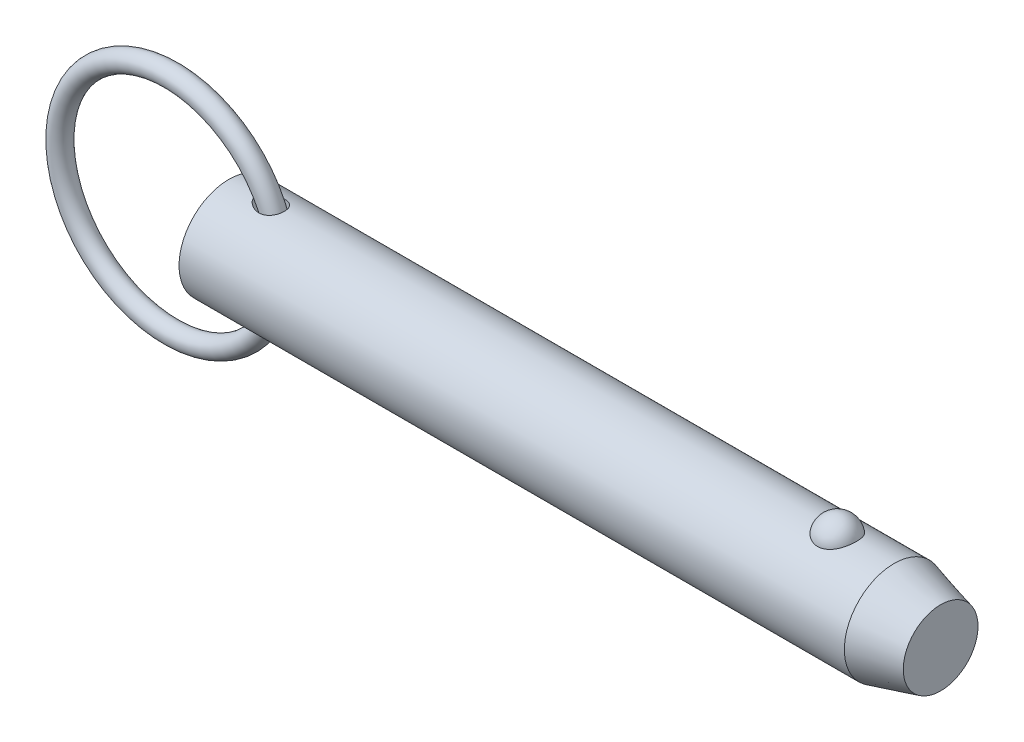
ISO-10303-21;
HEADER;
FILE_DESCRIPTION(('STEP AP214'),'2;1');
FILE_NAME('part.step','',(''),(''),'','','');
FILE_SCHEMA(('AUTOMOTIVE_DESIGN { 1 0 10303 214 1 1 1 1 }'));
ENDSEC;
DATA;
#1=APPLICATION_CONTEXT('core data for automotive mechanical design processes');
#2=APPLICATION_PROTOCOL_DEFINITION('international standard','automotive_design',2000,#1);
#3=PRODUCT_CONTEXT('',#1,'mechanical');
#4=PRODUCT('Part','Part','',(#3));
#5=PRODUCT_RELATED_PRODUCT_CATEGORY('part','',(#4));
#6=PRODUCT_DEFINITION_FORMATION('','',#4);
#7=PRODUCT_DEFINITION_CONTEXT('part definition',#1,'design');
#8=PRODUCT_DEFINITION('design','',#6,#7);
#9=PRODUCT_DEFINITION_SHAPE('','',#8);
#10=(LENGTH_UNIT() NAMED_UNIT(*) SI_UNIT(.MILLI.,.METRE.));
#11=(NAMED_UNIT(*) PLANE_ANGLE_UNIT() SI_UNIT($,.RADIAN.));
#12=(NAMED_UNIT(*) SI_UNIT($,.STERADIAN.) SOLID_ANGLE_UNIT());
#13=UNCERTAINTY_MEASURE_WITH_UNIT(LENGTH_MEASURE(1.E-05),#10,'distance_accuracy_value','');
#14=(GEOMETRIC_REPRESENTATION_CONTEXT(3) GLOBAL_UNCERTAINTY_ASSIGNED_CONTEXT((#13)) GLOBAL_UNIT_ASSIGNED_CONTEXT((#10,
#11,#12)) REPRESENTATION_CONTEXT('',''));
#15=CARTESIAN_POINT('',(0.,0.,0.));
#16=DIRECTION('',(0.,0.,1.));
#17=DIRECTION('',(1.,0.,0.));
#18=AXIS2_PLACEMENT_3D('',#15,#16,#17);
#19=CARTESIAN_POINT('',(-8.23730968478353,0.,0.));
#20=DIRECTION('',(0.,0.,1.));
#21=DIRECTION('',(1.,0.,0.));
#22=AXIS2_PLACEMENT_3D('',#19,#20,#21);
#23=TOROIDAL_SURFACE('',#22,15.875,1.422);
#24=CARTESIAN_POINT('',(9.05969031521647,0.,0.));
#25=VERTEX_POINT('',#24);
#26=VERTEX_LOOP('',#25);
#27=FACE_BOUND('',#26,.T.);
#28=ADVANCED_FACE('P0_F12',(#27),#23,.T.);
#29=CLOSED_SHELL('',(#28));
#30=MANIFOLD_SOLID_BREP('P0_B1',#29);
#31=CARTESIAN_POINT('',(0.,0.,0.));
#32=DIRECTION('',(1.,0.,0.));
#33=DIRECTION('',(0.,0.,-1.));
#34=AXIS2_PLACEMENT_3D('',#31,#32,#33);
#35=CYLINDRICAL_SURFACE('',#34,7.11);
#36=CARTESIAN_POINT('',(3.98467340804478,7.10072679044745,-0.363013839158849));
#37=CARTESIAN_POINT('',(4.00971652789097,7.09600153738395,-0.45539194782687));
#38=CARTESIAN_POINT('',(4.04401947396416,7.08958406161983,-0.545230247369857));
#39=CARTESIAN_POINT('',(4.12810160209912,7.07427055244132,-0.717157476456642));
#40=CARTESIAN_POINT('',(4.17791765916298,7.06536861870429,-0.799227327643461));
#41=CARTESIAN_POINT('',(4.28924471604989,7.04620300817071,-0.953469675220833));
#42=CARTESIAN_POINT('',(4.35063580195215,7.035953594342,-1.02573162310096));
#43=CARTESIAN_POINT('',(4.48282610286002,7.01493313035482,-1.16081412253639));
#44=CARTESIAN_POINT('',(4.55362244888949,7.00416223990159,-1.22363754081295));
#45=CARTESIAN_POINT('',(4.71659336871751,6.98090398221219,-1.35055080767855));
#46=CARTESIAN_POINT('',(4.81029272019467,6.96847103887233,-1.41269256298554));
#47=CARTESIAN_POINT('',(5.0057240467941,6.94515366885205,-1.52319699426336));
#48=CARTESIAN_POINT('',(5.10746392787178,6.93427079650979,-1.57154588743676));
#49=CARTESIAN_POINT('',(5.33503739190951,6.91346066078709,-1.66091325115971));
#50=CARTESIAN_POINT('',(5.46199550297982,6.90402388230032,-1.69921932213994));
#51=CARTESIAN_POINT('',(5.72084799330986,6.89024030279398,-1.75428261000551));
#52=CARTESIAN_POINT('',(5.85274301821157,6.88589416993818,-1.77103699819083));
#53=CARTESIAN_POINT('',(6.11557710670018,6.88337277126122,-1.78081990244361));
#54=CARTESIAN_POINT('',(6.24650031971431,6.88510489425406,-1.77420448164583));
#55=CARTESIAN_POINT('',(6.50446311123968,6.89478744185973,-1.73620392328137));
#56=CARTESIAN_POINT('',(6.6315075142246,6.90272978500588,-1.70485097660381));
#57=CARTESIAN_POINT('',(6.85933269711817,6.92243075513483,-1.62281888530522));
#58=CARTESIAN_POINT('',(6.96133251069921,6.93352131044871,-1.5753580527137));
#59=CARTESIAN_POINT('',(7.15436649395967,6.95824811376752,-1.46226310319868));
#60=CARTESIAN_POINT('',(7.24540699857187,6.97188287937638,-1.3966395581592));
#61=CARTESIAN_POINT('',(7.40446019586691,6.99838217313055,-1.25668991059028));
#62=CARTESIAN_POINT('',(7.473875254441,7.01118308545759,-1.18393777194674));
#63=CARTESIAN_POINT('',(7.59904891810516,7.03582803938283,-1.02736918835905));
#64=CARTESIAN_POINT('',(7.65481029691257,7.04767227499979,-0.943554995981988));
#65=CARTESIAN_POINT('',(7.74982438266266,7.06873077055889,-0.76979592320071));
#66=CARTESIAN_POINT('',(7.7894903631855,7.07800861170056,-0.680084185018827));
#67=CARTESIAN_POINT('',(7.85354088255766,7.09334756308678,-0.495102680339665));
#68=CARTESIAN_POINT('',(7.87792559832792,7.09940871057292,-0.399832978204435));
#69=CARTESIAN_POINT('',(7.9108898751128,7.10766731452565,-0.206294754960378));
#70=CARTESIAN_POINT('',(7.91944662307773,7.10985919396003,-0.108022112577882));
#71=CARTESIAN_POINT('',(7.920501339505,7.11012756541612,0.0886168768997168));
#72=CARTESIAN_POINT('',(7.91299895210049,7.10820396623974,0.186983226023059));
#73=CARTESIAN_POINT('',(7.88205794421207,7.10043733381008,0.381270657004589));
#74=CARTESIAN_POINT('',(7.85857985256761,7.09458459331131,0.477185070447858));
#75=CARTESIAN_POINT('',(7.79617406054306,7.07958431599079,0.663575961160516));
#76=CARTESIAN_POINT('',(7.75724672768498,7.07043685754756,0.754052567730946));
#77=CARTESIAN_POINT('',(7.66496731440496,7.04987259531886,0.926798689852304));
#78=CARTESIAN_POINT('',(7.61164530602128,7.0384605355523,1.00908483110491));
#79=CARTESIAN_POINT('',(7.49191707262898,7.01461776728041,1.16333092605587));
#80=CARTESIAN_POINT('',(7.42551210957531,7.00218715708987,1.235291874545));
#81=CARTESIAN_POINT('',(7.28164031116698,6.97770944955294,1.36680167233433));
#82=CARTESIAN_POINT('',(7.20420170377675,6.96566146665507,1.42638126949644));
#83=CARTESIAN_POINT('',(7.0403906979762,6.94319963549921,1.53199377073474));
#84=CARTESIAN_POINT('',(6.95401827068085,6.93278579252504,1.57802663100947));
#85=CARTESIAN_POINT('',(6.7731858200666,6.91444459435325,1.65656940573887));
#86=CARTESIAN_POINT('',(6.67860569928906,6.90656682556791,1.68881327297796));
#87=CARTESIAN_POINT('',(6.48544119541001,6.89422806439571,1.73849768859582));
#88=CARTESIAN_POINT('',(6.38685561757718,6.88976809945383,1.755933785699));
#89=CARTESIAN_POINT('',(6.18089829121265,6.88429907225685,1.77726234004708));
#90=CARTESIAN_POINT('',(6.07340937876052,6.88356485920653,1.78007646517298));
#91=CARTESIAN_POINT('',(5.85921220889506,6.886086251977,1.77029087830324));
#92=CARTESIAN_POINT('',(5.75250426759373,6.88934339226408,1.75768523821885));
#93=CARTESIAN_POINT('',(5.52848027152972,6.89994454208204,1.71563399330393));
#94=CARTESIAN_POINT('',(5.41155168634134,6.90775772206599,1.68424184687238));
#95=CARTESIAN_POINT('',(5.18376466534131,6.92670168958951,1.60454711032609));
#96=CARTESIAN_POINT('',(5.07291446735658,6.9378368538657,1.5562221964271));
#97=CARTESIAN_POINT('',(4.84835244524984,6.96347168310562,1.43744827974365));
#98=CARTESIAN_POINT('',(4.73562531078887,6.97820486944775,1.36517310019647));
#99=CARTESIAN_POINT('',(4.52504912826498,7.00822340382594,1.20158053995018));
#100=CARTESIAN_POINT('',(4.42717478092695,7.02350775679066,1.11029618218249));
#101=CARTESIAN_POINT('',(4.27935716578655,7.04784659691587,0.940654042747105));
#102=CARTESIAN_POINT('',(4.2239722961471,7.05736064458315,0.867099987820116));
#103=CARTESIAN_POINT('',(4.12558347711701,7.07469854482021,0.711919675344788));
#104=CARTESIAN_POINT('',(4.08256922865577,7.0825238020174,0.630300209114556));
#105=CARTESIAN_POINT('',(4.01142860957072,7.09565978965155,0.459428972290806));
#106=CARTESIAN_POINT('',(3.98346043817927,7.10094374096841,0.370107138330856));
#107=CARTESIAN_POINT('',(3.95517285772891,7.1063173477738,0.233358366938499));
#108=CARTESIAN_POINT('',(3.94802115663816,7.1076831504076,0.187321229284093));
#109=CARTESIAN_POINT('',(3.93842121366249,7.10951900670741,0.0947476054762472));
#110=CARTESIAN_POINT('',(3.93597129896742,7.10998937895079,0.0482113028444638));
#111=CARTESIAN_POINT('',(3.93584361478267,7.11001358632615,-0.0598597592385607));
#112=CARTESIAN_POINT('',(3.9399538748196,7.10922402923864,-0.121405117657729));
#113=CARTESIAN_POINT('',(3.95632793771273,7.10609781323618,-0.243320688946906));
#114=CARTESIAN_POINT('',(3.96859135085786,7.10376122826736,-0.303690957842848));
#115=CARTESIAN_POINT('',(3.98467340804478,7.10072679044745,-0.363013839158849));
#116=B_SPLINE_CURVE_WITH_KNOTS('',3,(#36,#37,#38,#39,#40,#41,#42,#43,#44,#45,#46,#47,#48,#49,
#50,#51,#52,#53,#54,#55,#56,#57,#58,#59,#60,#61,#62,#63,#64,#65,#66,#67,#68,#69,#70,#71,#72,#73,
#74,#75,#76,#77,#78,#79,#80,#81,#82,#83,#84,#85,#86,#87,#88,#89,#90,#91,#92,#93,#94,#95,#96,#97,
#98,#99,#100,#101,#102,#103,#104,#105,#106,#107,#108,#109,#110,#111,#112,#113,#114,#115),
.UNSPECIFIED.,.T.,.F.,(4,2,2,2,2,2,2,2,2,2,2,2,2,2,2,2,2,2,2,2,2,2,2,2,2,2,2,2,2,2,2,2,2,2,2,2,
2,2,2,4),(0.,0.287206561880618,0.575101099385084,0.860162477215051,1.14513709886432,
1.48324846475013,1.82169652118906,2.21865672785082,2.6156690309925,3.00665870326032,
3.39714041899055,3.73437585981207,4.07141541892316,4.37402271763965,4.67656849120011,
4.97076150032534,5.26495110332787,5.55956439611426,5.85418421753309,6.14953461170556,
6.44487798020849,6.73960905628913,7.03431171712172,7.32827352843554,7.6222362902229,
7.9216396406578,8.22113296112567,8.54242840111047,8.86384740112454,9.22635035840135,
9.58933304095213,9.99153142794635,10.3930368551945,10.6697219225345,10.9461759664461,
11.2254825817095,11.3650959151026,11.5046595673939,11.6891051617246,11.8735419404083),.UNSPECIFIED.);
#117=CARTESIAN_POINT('',(3.98467340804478,7.10072679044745,-0.363013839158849));
#118=VERTEX_POINT('',#117);
#119=EDGE_CURVE('P1_E40',#118,#118,#116,.T.);
#120=ORIENTED_EDGE('',*,*,#119,.T.);
#121=EDGE_LOOP('',(#120));
#122=FACE_BOUND('',#121,.T.);
#123=CARTESIAN_POINT('',(94.9362796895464,0.,0.));
#124=DIRECTION('',(1.,0.,0.));
#125=DIRECTION('',(0.,0.,-1.));
#126=AXIS2_PLACEMENT_3D('',#123,#124,#125);
#127=CIRCLE('',#126,7.11);
#128=CARTESIAN_POINT('',(94.9362796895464,0.,-7.11));
#129=VERTEX_POINT('',#128);
#130=EDGE_CURVE('P1_E25',#129,#129,#127,.T.);
#131=ORIENTED_EDGE('',*,*,#130,.F.);
#132=EDGE_LOOP('',(#131));
#133=FACE_BOUND('',#132,.T.);
#134=CARTESIAN_POINT('',(0.,0.,0.));
#135=DIRECTION('',(1.,0.,0.));
#136=DIRECTION('',(0.,0.,-1.));
#137=AXIS2_PLACEMENT_3D('',#134,#135,#136);
#138=CIRCLE('',#137,7.11);
#139=CARTESIAN_POINT('',(0.,0.,-7.11));
#140=VERTEX_POINT('',#139);
#141=EDGE_CURVE('P1_E9',#140,#140,#138,.T.);
#142=ORIENTED_EDGE('',*,*,#141,.T.);
#143=EDGE_LOOP('',(#142));
#144=FACE_BOUND('',#143,.T.);
#145=CARTESIAN_POINT('',(86.829258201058,6.53646663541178,2.79762469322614));
#146=CARTESIAN_POINT('',(86.6844296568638,6.53647876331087,2.79761243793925));
#147=CARTESIAN_POINT('',(86.5393684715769,6.54144531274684,2.78608115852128));
#148=CARTESIAN_POINT('',(86.2532920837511,6.56077791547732,2.74023282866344));
#149=CARTESIAN_POINT('',(86.1122884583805,6.57516852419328,2.70585624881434));
#150=CARTESIAN_POINT('',(85.8388833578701,6.61165072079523,2.6154404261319));
#151=CARTESIAN_POINT('',(85.7064602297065,6.63372195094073,2.55945840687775));
#152=CARTESIAN_POINT('',(85.4532337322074,6.68316012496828,2.42742958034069));
#153=CARTESIAN_POINT('',(85.3324254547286,6.71052481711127,2.35139129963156));
#154=CARTESIAN_POINT('',(85.1016372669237,6.76860821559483,2.17866150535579));
#155=CARTESIAN_POINT('',(84.9920857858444,6.79940242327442,2.08142342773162));
#156=CARTESIAN_POINT('',(84.7903340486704,6.86050242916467,1.87020907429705));
#157=CARTESIAN_POINT('',(84.6981390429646,6.89080807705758,1.75622775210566));
#158=CARTESIAN_POINT('',(84.5292547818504,6.94923069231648,1.50900646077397));
#159=CARTESIAN_POINT('',(84.4534289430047,6.97719213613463,1.37513873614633));
#160=CARTESIAN_POINT('',(84.3242063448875,7.02647251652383,1.09584817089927));
#161=CARTESIAN_POINT('',(84.2708109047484,7.04779106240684,0.950424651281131));
#162=CARTESIAN_POINT('',(84.1871019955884,7.08180248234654,0.650508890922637));
#163=CARTESIAN_POINT('',(84.1570253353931,7.09440672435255,0.495940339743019));
#164=CARTESIAN_POINT('',(84.121473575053,7.10935121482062,0.183515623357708));
#165=CARTESIAN_POINT('',(84.1159974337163,7.11169189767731,0.0256595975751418));
#166=CARTESIAN_POINT('',(84.129700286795,7.10589702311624,-0.287512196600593));
#167=CARTESIAN_POINT('',(84.1486823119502,7.0978451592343,-0.442838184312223));
#168=CARTESIAN_POINT('',(84.2105745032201,7.07221860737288,-0.747830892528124));
#169=CARTESIAN_POINT('',(84.2534850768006,7.05464375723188,-0.897497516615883));
#170=CARTESIAN_POINT('',(84.3624527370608,7.01171031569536,-1.18722864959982));
#171=CARTESIAN_POINT('',(84.4285458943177,6.98633960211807,-1.32727778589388));
#172=CARTESIAN_POINT('',(84.5825362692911,6.93042258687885,-1.59370324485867));
#173=CARTESIAN_POINT('',(84.6704355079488,6.89987580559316,-1.72007829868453));
#174=CARTESIAN_POINT('',(84.8669269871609,6.83659510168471,-1.95657345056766));
#175=CARTESIAN_POINT('',(84.9756640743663,6.80384697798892,-2.06656957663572));
#176=CARTESIAN_POINT('',(85.2109686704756,6.74001831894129,-2.26611005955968));
#177=CARTESIAN_POINT('',(85.3375350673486,6.7089376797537,-2.3556556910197));
#178=CARTESIAN_POINT('',(85.6028454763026,6.65264442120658,-2.51019726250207));
#179=CARTESIAN_POINT('',(85.7413230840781,6.62733449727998,-2.57561395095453));
#180=CARTESIAN_POINT('',(86.0285194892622,6.58495995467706,-2.68211134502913));
#181=CARTESIAN_POINT('',(86.1772343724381,6.56789220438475,-2.72320129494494));
#182=CARTESIAN_POINT('',(86.4726268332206,6.54478663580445,-2.77825810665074));
#183=CARTESIAN_POINT('',(86.6190295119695,6.53823639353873,-2.79348727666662));
#184=CARTESIAN_POINT('',(86.9124700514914,6.5353271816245,-2.80028921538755));
#185=CARTESIAN_POINT('',(87.0595077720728,6.53896606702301,-2.79186696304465));
#186=CARTESIAN_POINT('',(87.3449210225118,6.55570357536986,-2.75232178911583));
#187=CARTESIAN_POINT('',(87.4834221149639,6.56848455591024,-2.72196077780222));
#188=CARTESIAN_POINT('',(87.7531142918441,6.60173528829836,-2.64028774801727));
#189=CARTESIAN_POINT('',(87.884304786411,6.62220565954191,-2.58897404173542));
#190=CARTESIAN_POINT('',(88.1388462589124,6.66917927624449,-2.46547820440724));
#191=CARTESIAN_POINT('',(88.2619691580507,6.69580233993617,-2.39287266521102));
#192=CARTESIAN_POINT('',(88.4944418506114,6.75207041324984,-2.22915269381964));
#193=CARTESIAN_POINT('',(88.6037884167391,6.78171612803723,-2.13803393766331));
#194=CARTESIAN_POINT('',(88.811642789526,6.8426462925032,-1.93445592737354));
#195=CARTESIAN_POINT('',(88.9093178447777,6.87393748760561,-1.8211477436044));
#196=CARTESIAN_POINT('',(89.0850112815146,6.93345710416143,-1.57947787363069));
#197=CARTESIAN_POINT('',(89.1630261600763,6.96168497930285,-1.45111351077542));
#198=CARTESIAN_POINT('',(89.2999857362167,7.01307558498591,-1.17842708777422));
#199=CARTESIAN_POINT('',(89.3582588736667,7.03605262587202,-1.03373189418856));
#200=CARTESIAN_POINT('',(89.4510815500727,7.07340932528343,-0.735867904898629));
#201=CARTESIAN_POINT('',(89.4856311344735,7.08778900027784,-0.582699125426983));
#202=CARTESIAN_POINT('',(89.530274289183,7.10647639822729,-0.272420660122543));
#203=CARTESIAN_POINT('',(89.54039710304,7.11079616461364,-0.115315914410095));
#204=CARTESIAN_POINT('',(89.536061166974,7.10896059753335,0.198488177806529));
#205=CARTESIAN_POINT('',(89.5216031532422,7.10280557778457,0.355187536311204));
#206=CARTESIAN_POINT('',(89.4685727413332,7.08071500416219,0.662724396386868));
#207=CARTESIAN_POINT('',(89.4301505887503,7.06484039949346,0.813592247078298));
#208=CARTESIAN_POINT('',(89.3301012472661,7.0249589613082,1.10629159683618));
#209=CARTESIAN_POINT('',(89.2684724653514,7.00095156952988,1.24812247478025));
#210=CARTESIAN_POINT('',(89.1227668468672,6.94706632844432,1.51976439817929));
#211=CARTESIAN_POINT('',(89.0385448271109,6.91715085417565,1.64949012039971));
#212=CARTESIAN_POINT('',(88.8495861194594,6.85470565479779,1.8923128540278));
#213=CARTESIAN_POINT('',(88.7448501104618,6.82217601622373,2.00541041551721));
#214=CARTESIAN_POINT('',(88.5171030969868,6.75805358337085,2.21190674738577));
#215=CARTESIAN_POINT('',(88.394082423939,6.72646129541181,2.30529503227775));
#216=CARTESIAN_POINT('',(88.1327347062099,6.66789520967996,2.46959908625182));
#217=CARTESIAN_POINT('',(87.9944019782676,6.64092313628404,2.54050647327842));
#218=CARTESIAN_POINT('',(87.7111828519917,6.59572583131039,2.6556004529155));
#219=CARTESIAN_POINT('',(87.5666660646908,6.57724013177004,2.70059539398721));
#220=CARTESIAN_POINT('',(87.2715469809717,6.55006426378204,2.76587321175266));
#221=CARTESIAN_POINT('',(87.1209640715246,6.54134511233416,2.78622922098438));
#222=CARTESIAN_POINT('',(86.9230463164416,6.53697847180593,2.79642434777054));
#223=CARTESIAN_POINT('',(86.8761644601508,6.53646270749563,2.79762866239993));
#224=CARTESIAN_POINT('',(86.829258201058,6.53646663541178,2.79762469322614));
#225=B_SPLINE_CURVE_WITH_KNOTS('',3,(#145,#146,#147,#148,#149,#150,#151,#152,#153,#154,#155,
#156,#157,#158,#159,#160,#161,#162,#163,#164,#165,#166,#167,#168,#169,#170,#171,#172,#173,#174,
#175,#176,#177,#178,#179,#180,#181,#182,#183,#184,#185,#186,#187,#188,#189,#190,#191,#192,#193,
#194,#195,#196,#197,#198,#199,#200,#201,#202,#203,#204,#205,#206,#207,#208,#209,#210,#211,#212,
#213,#214,#215,#216,#217,#218,#219,#220,#221,#222,#223,#224),.UNSPECIFIED.,.T.,.F.,(4,2,2,2,2,2,
2,2,2,2,2,2,2,2,2,2,2,2,2,2,2,2,2,2,2,2,2,2,2,2,2,2,2,2,2,2,2,2,2,4),(0.,0.434355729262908,
0.869847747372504,1.30419416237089,1.738356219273,2.1854192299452,2.63261726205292,
3.0995426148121,3.56649542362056,4.0381303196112,4.50974525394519,4.97758575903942,
5.44543423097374,5.9140138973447,6.38263700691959,6.85464418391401,7.32662193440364,
7.78992971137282,8.25306131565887,8.69285754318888,9.13256119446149,9.55768625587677,
9.98284556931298,10.4171106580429,10.851477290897,11.3079089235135,11.7644218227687,
12.2351898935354,12.7059570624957,13.1761603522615,13.6463495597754,14.1136200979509,
14.5809227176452,15.0513032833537,15.5216682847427,15.9922828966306,16.4630727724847,
16.9182457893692,17.3720644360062,17.5127411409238),.UNSPECIFIED.);
#226=CARTESIAN_POINT('',(86.829258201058,6.53646663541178,2.79762469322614));
#227=VERTEX_POINT('',#226);
#228=EDGE_CURVE('P1_E34',#227,#227,#225,.T.);
#229=ORIENTED_EDGE('',*,*,#228,.T.);
#230=EDGE_LOOP('',(#229));
#231=FACE_BOUND('',#230,.T.);
#232=CARTESIAN_POINT('',(3.98467340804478,-7.10072679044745,-0.363013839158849));
#233=CARTESIAN_POINT('',(3.96426456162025,-7.10457733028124,-0.287714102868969));
#234=CARTESIAN_POINT('',(3.95000501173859,-7.10730349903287,-0.210695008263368));
#235=CARTESIAN_POINT('',(3.93481801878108,-7.11020840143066,-0.0553038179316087));
#236=CARTESIAN_POINT('',(3.93388435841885,-7.11038832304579,0.0230676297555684));
#237=CARTESIAN_POINT('',(3.94541910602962,-7.10817995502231,0.178714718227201));
#238=CARTESIAN_POINT('',(3.95787987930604,-7.10579312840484,0.25599095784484));
#239=CARTESIAN_POINT('',(3.99523775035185,-7.09872642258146,0.407352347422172));
#240=CARTESIAN_POINT('',(4.02014065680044,-7.09404547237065,0.481435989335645));
#241=CARTESIAN_POINT('',(4.08119600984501,-7.08278363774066,0.625775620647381));
#242=CARTESIAN_POINT('',(4.11749458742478,-7.07617815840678,0.695967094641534));
#243=CARTESIAN_POINT('',(4.19940836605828,-7.06165305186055,0.830508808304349));
#244=CARTESIAN_POINT('',(4.24502952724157,-7.0537325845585,0.894855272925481));
#245=CARTESIAN_POINT('',(4.36790232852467,-7.03310314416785,1.04688574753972));
#246=CARTESIAN_POINT('',(4.44977459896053,-7.01993229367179,1.13078695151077));
#247=CARTESIAN_POINT('',(4.62610796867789,-6.99351259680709,1.28411726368));
#248=CARTESIAN_POINT('',(4.7205898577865,-6.98026365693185,1.35352197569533));
#249=CARTESIAN_POINT('',(4.92036507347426,-6.9549104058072,1.47831921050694));
#250=CARTESIAN_POINT('',(5.02579054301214,-6.94282458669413,1.53350332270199));
#251=CARTESIAN_POINT('',(5.24378330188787,-6.92129098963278,1.62793610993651));
#252=CARTESIAN_POINT('',(5.35635066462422,-6.91184323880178,1.66718462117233));
#253=CARTESIAN_POINT('',(5.60134354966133,-6.89573491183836,1.73269893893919));
#254=CARTESIAN_POINT('',(5.73444697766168,-6.8895970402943,1.75661057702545));
#255=CARTESIAN_POINT('',(6.00300738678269,-6.88344616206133,1.78057487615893));
#256=CARTESIAN_POINT('',(6.13846360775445,-6.88343121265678,1.78063510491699));
#257=CARTESIAN_POINT('',(6.39660470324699,-6.88981379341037,1.75576480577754));
#258=CARTESIAN_POINT('',(6.51947843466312,-6.89572457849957,1.73273121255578));
#259=CARTESIAN_POINT('',(6.75813770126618,-6.91274434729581,1.66352936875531));
#260=CARTESIAN_POINT('',(6.87393155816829,-6.92384709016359,1.61738888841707));
#261=CARTESIAN_POINT('',(7.07801861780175,-6.94787316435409,1.51052664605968));
#262=CARTESIAN_POINT('',(7.16789841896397,-6.96033024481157,1.45271574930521));
#263=CARTESIAN_POINT('',(7.33546773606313,-6.98638661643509,1.32171912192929));
#264=CARTESIAN_POINT('',(7.41316182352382,-6.99998547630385,1.24853918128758));
#265=CARTESIAN_POINT('',(7.54861420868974,-7.02559503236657,1.09486170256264));
#266=CARTESIAN_POINT('',(7.60741145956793,-7.03764930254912,1.01528346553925));
#267=CARTESIAN_POINT('',(7.71070740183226,-7.0598657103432,0.847099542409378));
#268=CARTESIAN_POINT('',(7.75520788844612,-7.0700280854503,0.758494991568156));
#269=CARTESIAN_POINT('',(7.82836147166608,-7.08722075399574,0.575936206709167));
#270=CARTESIAN_POINT('',(7.85719783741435,-7.09428707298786,0.482058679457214));
#271=CARTESIAN_POINT('',(7.89918378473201,-7.10470260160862,0.29065874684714));
#272=CARTESIAN_POINT('',(7.91233308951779,-7.10805174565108,0.193136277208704));
#273=CARTESIAN_POINT('',(7.92267451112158,-7.11067890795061,-0.00313968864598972));
#274=CARTESIAN_POINT('',(7.91981203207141,-7.10994299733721,-0.10189624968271));
#275=CARTESIAN_POINT('',(7.89806489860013,-7.10444651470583,-0.297516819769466));
#276=CARTESIAN_POINT('',(7.87918005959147,-7.09968589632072,-0.394380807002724));
#277=CARTESIAN_POINT('',(7.82577988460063,-7.0866471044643,-0.58355375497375));
#278=CARTESIAN_POINT('',(7.79124976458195,-7.07836560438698,-0.675858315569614));
#279=CARTESIAN_POINT('',(7.70736343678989,-7.05919003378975,-0.853167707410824));
#280=CARTESIAN_POINT('',(7.65800801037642,-7.04829610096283,-0.938172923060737));
#281=CARTESIAN_POINT('',(7.54590141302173,-7.02513961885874,-1.09819812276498));
#282=CARTESIAN_POINT('',(7.48319521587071,-7.01288172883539,-1.17325029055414));
#283=CARTESIAN_POINT('',(7.34599775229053,-6.98832192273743,-1.31164333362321));
#284=CARTESIAN_POINT('',(7.27150757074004,-6.97602001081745,-1.37498528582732));
#285=CARTESIAN_POINT('',(7.11277776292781,-6.95268608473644,-1.48849974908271));
#286=CARTESIAN_POINT('',(7.02852525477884,-6.94165578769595,-1.53865456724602));
#287=CARTESIAN_POINT('',(6.85282430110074,-6.92200320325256,-1.62478650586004));
#288=CARTESIAN_POINT('',(6.76137511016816,-6.91338116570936,-1.66076215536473));
#289=CARTESIAN_POINT('',(6.57061179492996,-6.89906044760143,-1.71930563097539));
#290=CARTESIAN_POINT('',(6.47113516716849,-6.89347290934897,-1.74136795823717));
#291=CARTESIAN_POINT('',(6.26989833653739,-6.88605020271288,-1.7704895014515));
#292=CARTESIAN_POINT('',(6.16813737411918,-6.88421630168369,-1.77754365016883));
#293=CARTESIAN_POINT('',(5.95492537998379,-6.88424071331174,-1.77745174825));
#294=CARTESIAN_POINT('',(5.8434768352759,-6.88646827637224,-1.76888555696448));
#295=CARTESIAN_POINT('',(5.62307560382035,-6.89483827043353,-1.73596677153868));
#296=CARTESIAN_POINT('',(5.51412477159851,-6.90098351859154,-1.71160281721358));
#297=CARTESIAN_POINT('',(5.28644478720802,-6.91743803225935,-1.64393691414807));
#298=CARTESIAN_POINT('',(5.16837217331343,-6.92819628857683,-1.59852806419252));
#299=CARTESIAN_POINT('',(4.94091825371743,-6.95234836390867,-1.4899796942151));
#300=CARTESIAN_POINT('',(4.83153887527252,-6.96574276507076,-1.42683625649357));
#301=CARTESIAN_POINT('',(4.63576710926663,-6.99209234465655,-1.29112257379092));
#302=CARTESIAN_POINT('',(4.54816728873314,-7.00494184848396,-1.22027748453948));
#303=CARTESIAN_POINT('',(4.38554897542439,-7.03019055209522,-1.0652111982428));
#304=CARTESIAN_POINT('',(4.31052141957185,-7.04259007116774,-0.980999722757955));
#305=CARTESIAN_POINT('',(4.18551811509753,-7.0640229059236,-0.811206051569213));
#306=CARTESIAN_POINT('',(4.13358417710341,-7.07328321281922,-0.727107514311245));
#307=CARTESIAN_POINT('',(4.04607461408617,-7.0891994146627,-0.550580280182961));
#308=CARTESIAN_POINT('',(4.01046401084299,-7.09586087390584,-0.458169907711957));
#309=CARTESIAN_POINT('',(3.98467340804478,-7.10072679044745,-0.363013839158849));
#310=B_SPLINE_CURVE_WITH_KNOTS('',3,(#232,#233,#234,#235,#236,#237,#238,#239,#240,#241,#242,
#243,#244,#245,#246,#247,#248,#249,#250,#251,#252,#253,#254,#255,#256,#257,#258,#259,#260,#261,
#262,#263,#264,#265,#266,#267,#268,#269,#270,#271,#272,#273,#274,#275,#276,#277,#278,#279,#280,
#281,#282,#283,#284,#285,#286,#287,#288,#289,#290,#291,#292,#293,#294,#295,#296,#297,#298,#299,
#300,#301,#302,#303,#304,#305,#306,#307,#308,#309),.UNSPECIFIED.,.T.,.F.,(4,2,2,2,2,2,2,2,2,2,2,
2,2,2,2,2,2,2,2,2,2,2,2,2,2,2,2,2,2,2,2,2,2,2,2,2,2,2,4),(0.,0.23402065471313,0.467932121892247,
0.701710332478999,0.935597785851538,1.17261620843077,1.40978663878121,1.76177576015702,
2.11435255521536,2.47183528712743,2.8293216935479,3.23332937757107,3.63720887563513,
4.01042610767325,4.38319587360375,4.70425151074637,5.02518641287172,5.32277979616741,
5.62033579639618,5.91433101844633,6.2083314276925,6.50333490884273,6.79834178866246,
7.09362801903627,7.38889868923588,7.6831900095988,7.9774542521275,8.27211131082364,
8.56679892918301,8.8716552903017,9.17661456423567,9.51069129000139,9.84500851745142,
10.2243046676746,10.6036846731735,10.9425776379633,11.2812252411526,11.5775945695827,
11.8733258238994),.UNSPECIFIED.);
#311=CARTESIAN_POINT('',(3.98467340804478,-7.10072679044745,-0.363013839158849));
#312=VERTEX_POINT('',#311);
#313=EDGE_CURVE('P1_E17',#312,#312,#310,.T.);
#314=ORIENTED_EDGE('',*,*,#313,.T.);
#315=EDGE_LOOP('',(#314));
#316=FACE_BOUND('',#315,.T.);
#317=ADVANCED_FACE('P1_F13',(#122,#133,#144,#231,#316),#35,.T.);
#318=CARTESIAN_POINT('',(0.,0.,0.));
#319=DIRECTION('',(-1.,0.,0.));
#320=DIRECTION('',(0.,0.,1.));
#321=AXIS2_PLACEMENT_3D('',#318,#319,#320);
#322=PLANE('',#321);
#323=ORIENTED_EDGE('',*,*,#141,.F.);
#324=EDGE_LOOP('',(#323));
#325=FACE_BOUND('',#324,.T.);
#326=ADVANCED_FACE('P1_F15',(#325),#322,.T.);
#327=CARTESIAN_POINT('',(101.57,0.,0.));
#328=DIRECTION('',(-1.,0.,0.));
#329=DIRECTION('',(0.,0.,1.));
#330=AXIS2_PLACEMENT_3D('',#327,#328,#329);
#331=CONICAL_SURFACE('',#330,5.33250000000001,0.26179938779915);
#332=ORIENTED_EDGE('',*,*,#130,.T.);
#333=EDGE_LOOP('',(#332));
#334=FACE_BOUND('',#333,.T.);
#335=CARTESIAN_POINT('',(101.57,0.,0.));
#336=DIRECTION('',(1.,0.,0.));
#337=DIRECTION('',(0.,0.,-1.));
#338=AXIS2_PLACEMENT_3D('',#335,#336,#337);
#339=CIRCLE('',#338,5.33250000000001);
#340=CARTESIAN_POINT('',(101.57,0.,-5.33250000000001));
#341=VERTEX_POINT('',#340);
#342=EDGE_CURVE('P1_E30',#341,#341,#339,.T.);
#343=ORIENTED_EDGE('',*,*,#342,.F.);
#344=EDGE_LOOP('',(#343));
#345=FACE_BOUND('',#344,.T.);
#346=ADVANCED_FACE('P1_F55',(#334,#345),#331,.T.);
#347=CARTESIAN_POINT('',(101.57,5.33250000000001,0.));
#348=DIRECTION('',(1.,0.,0.));
#349=DIRECTION('',(0.,0.,-1.));
#350=AXIS2_PLACEMENT_3D('',#347,#348,#349);
#351=PLANE('',#350);
#352=ORIENTED_EDGE('',*,*,#342,.T.);
#353=EDGE_LOOP('',(#352));
#354=FACE_BOUND('',#353,.T.);
#355=ADVANCED_FACE('P1_F51',(#354),#351,.T.);
#356=CARTESIAN_POINT('',(86.829258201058,6.399,0.));
#357=DIRECTION('',(-1.,0.,0.));
#358=DIRECTION('',(0.,-1.,0.));
#359=AXIS2_PLACEMENT_3D('',#356,#357,#358);
#360=SPHERICAL_SURFACE('',#359,2.80100000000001);
#361=ORIENTED_EDGE('',*,*,#228,.F.);
#362=EDGE_LOOP('',(#361));
#363=FACE_BOUND('',#362,.T.);
#364=ADVANCED_FACE('P1_F46',(#363),#360,.T.);
#365=CARTESIAN_POINT('',(-8.23730968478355,0.,0.));
#366=DIRECTION('',(0.,0.,1.));
#367=DIRECTION('',(1.,0.,0.));
#368=AXIS2_PLACEMENT_3D('',#365,#366,#367);
#369=TOROIDAL_SURFACE('',#368,15.875,1.7775);
#370=ORIENTED_EDGE('',*,*,#313,.F.);
#371=EDGE_LOOP('',(#370));
#372=FACE_BOUND('',#371,.T.);
#373=ORIENTED_EDGE('',*,*,#119,.F.);
#374=EDGE_LOOP('',(#373));
#375=FACE_BOUND('',#374,.T.);
#376=ADVANCED_FACE('P1_F50',(#372,#375),#369,.F.);
#377=CLOSED_SHELL('',(#317,#326,#346,#355,#364,#376));
#378=MANIFOLD_SOLID_BREP('P1_B1',#377);
#379=ADVANCED_BREP_SHAPE_REPRESENTATION('',(#18,#30,#378),#14);
#380=SHAPE_DEFINITION_REPRESENTATION(#9,#379);
ENDSEC;
END-ISO-10303-21;
